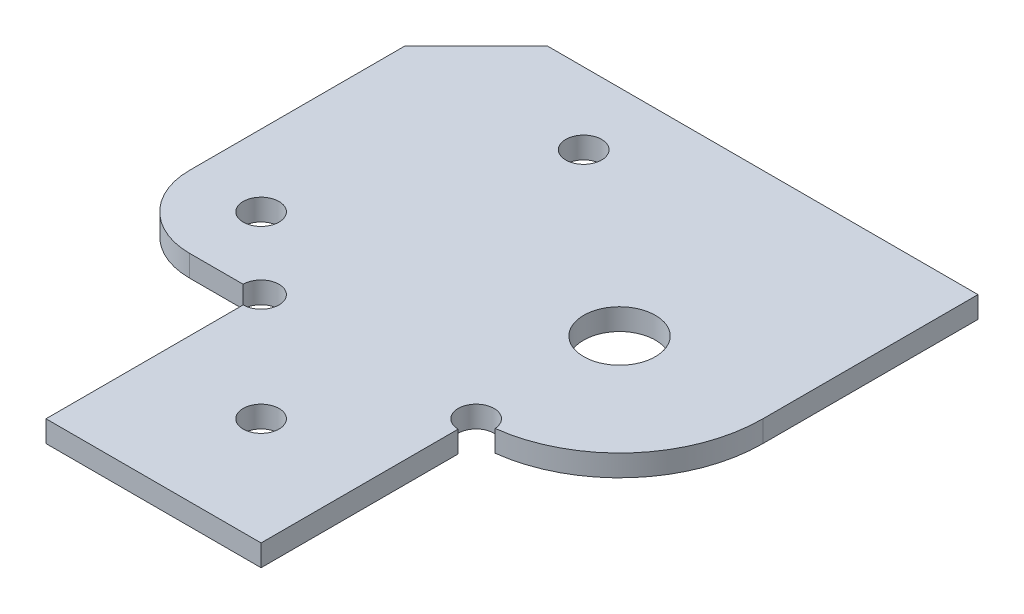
ISO-10303-21;
HEADER;
FILE_DESCRIPTION(('STEP AP214'),'2;1');
FILE_NAME('part.step','',(''),(''),'','','');
FILE_SCHEMA(('AUTOMOTIVE_DESIGN { 1 0 10303 214 1 1 1 1 }'));
ENDSEC;
DATA;
#1=APPLICATION_CONTEXT('core data for automotive mechanical design processes');
#2=APPLICATION_PROTOCOL_DEFINITION('international standard','automotive_design',2000,#1);
#3=PRODUCT_CONTEXT('',#1,'mechanical');
#4=PRODUCT('Part','Part','',(#3));
#5=PRODUCT_RELATED_PRODUCT_CATEGORY('part','',(#4));
#6=PRODUCT_DEFINITION_FORMATION('','',#4);
#7=PRODUCT_DEFINITION_CONTEXT('part definition',#1,'design');
#8=PRODUCT_DEFINITION('design','',#6,#7);
#9=PRODUCT_DEFINITION_SHAPE('','',#8);
#10=(LENGTH_UNIT() NAMED_UNIT(*) SI_UNIT(.MILLI.,.METRE.));
#11=(NAMED_UNIT(*) PLANE_ANGLE_UNIT() SI_UNIT($,.RADIAN.));
#12=(NAMED_UNIT(*) SI_UNIT($,.STERADIAN.) SOLID_ANGLE_UNIT());
#13=UNCERTAINTY_MEASURE_WITH_UNIT(LENGTH_MEASURE(1.E-05),#10,'distance_accuracy_value','');
#14=(GEOMETRIC_REPRESENTATION_CONTEXT(3) GLOBAL_UNCERTAINTY_ASSIGNED_CONTEXT((#13)) GLOBAL_UNIT_ASSIGNED_CONTEXT((#10,
#11,#12)) REPRESENTATION_CONTEXT('',''));
#15=CARTESIAN_POINT('',(0.,0.,0.));
#16=DIRECTION('',(0.,0.,1.));
#17=DIRECTION('',(1.,0.,0.));
#18=AXIS2_PLACEMENT_3D('',#15,#16,#17);
#19=CARTESIAN_POINT('',(10.,3.,-40.));
#20=DIRECTION('',(0.,1.,0.));
#21=DIRECTION('',(0.,0.,1.));
#22=AXIS2_PLACEMENT_3D('',#19,#20,#21);
#23=PLANE('',#22);
#24=CARTESIAN_POINT('',(10.,3.,-40.));
#25=DIRECTION('',(0.,1.,0.));
#26=DIRECTION('',(0.,0.,1.));
#27=AXIS2_PLACEMENT_3D('',#24,#25,#26);
#28=CIRCLE('',#27,2.5);
#29=CARTESIAN_POINT('',(10.,3.,-37.5));
#30=VERTEX_POINT('',#29);
#31=EDGE_CURVE('E287',#30,#30,#28,.T.);
#32=ORIENTED_EDGE('',*,*,#31,.F.);
#33=EDGE_LOOP('',(#32));
#34=FACE_BOUND('',#33,.T.);
#35=CARTESIAN_POINT('',(35.,3.,-15.));
#36=DIRECTION('',(0.,1.,0.));
#37=DIRECTION('',(0.,0.,1.));
#38=AXIS2_PLACEMENT_3D('',#35,#36,#37);
#39=CIRCLE('',#38,2.5);
#40=CARTESIAN_POINT('',(35.,3.,-12.5));
#41=VERTEX_POINT('',#40);
#42=EDGE_CURVE('E153',#41,#41,#39,.T.);
#43=ORIENTED_EDGE('',*,*,#42,.F.);
#44=EDGE_LOOP('',(#43));
#45=FACE_BOUND('',#44,.T.);
#46=DIRECTION('',(0.,0.,-1.));
#47=VECTOR('',#46,1.);
#48=CARTESIAN_POINT('',(70.,3.,-50.));
#49=LINE('',#48,#47);
#50=CARTESIAN_POINT('',(70.,3.,-50.));
#51=VERTEX_POINT('',#50);
#52=CARTESIAN_POINT('',(70.,3.,-80.));
#53=VERTEX_POINT('',#52);
#54=EDGE_CURVE('E172',#51,#53,#49,.T.);
#55=ORIENTED_EDGE('',*,*,#54,.T.);
#56=DIRECTION('',(-1.,0.,0.));
#57=VECTOR('',#56,1.);
#58=CARTESIAN_POINT('',(10.,3.,-80.));
#59=LINE('',#58,#57);
#60=CARTESIAN_POINT('',(10.,3.,-80.));
#61=VERTEX_POINT('',#60);
#62=EDGE_CURVE('E100',#53,#61,#59,.T.);
#63=ORIENTED_EDGE('',*,*,#62,.T.);
#64=DIRECTION('',(-0.707106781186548,0.,0.707106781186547));
#65=VECTOR('',#64,1.);
#66=CARTESIAN_POINT('',(10.,3.,-80.));
#67=LINE('',#66,#65);
#68=CARTESIAN_POINT('',(0.,3.,-70.));
#69=VERTEX_POINT('',#68);
#70=EDGE_CURVE('E199',#61,#69,#67,.T.);
#71=ORIENTED_EDGE('',*,*,#70,.T.);
#72=DIRECTION('',(0.,0.,1.));
#73=VECTOR('',#72,1.);
#74=CARTESIAN_POINT('',(0.,3.,-40.));
#75=LINE('',#74,#73);
#76=CARTESIAN_POINT('',(0.,3.,-40.));
#77=VERTEX_POINT('',#76);
#78=EDGE_CURVE('E218',#69,#77,#75,.T.);
#79=ORIENTED_EDGE('',*,*,#78,.T.);
#80=CARTESIAN_POINT('',(10.,3.,-40.));
#81=DIRECTION('',(0.,1.,0.));
#82=DIRECTION('',(0.,0.,1.));
#83=AXIS2_PLACEMENT_3D('',#80,#81,#82);
#84=CIRCLE('',#83,10.);
#85=CARTESIAN_POINT('',(10.,3.,-30.));
#86=VERTEX_POINT('',#85);
#87=EDGE_CURVE('E215',#77,#86,#84,.T.);
#88=ORIENTED_EDGE('',*,*,#87,.T.);
#89=DIRECTION('',(1.,0.,0.));
#90=VECTOR('',#89,1.);
#91=CARTESIAN_POINT('',(10.,3.,-30.));
#92=LINE('',#91,#90);
#93=CARTESIAN_POINT('',(17.5,3.,-30.));
#94=VERTEX_POINT('',#93);
#95=EDGE_CURVE('E217',#86,#94,#92,.T.);
#96=ORIENTED_EDGE('',*,*,#95,.T.);
#97=CARTESIAN_POINT('',(20.,3.,-30.));
#98=DIRECTION('',(0.,-1.,0.));
#99=DIRECTION('',(0.,0.,1.));
#100=AXIS2_PLACEMENT_3D('',#97,#98,#99);
#101=CIRCLE('',#100,2.5);
#102=CARTESIAN_POINT('',(20.,3.,-27.5));
#103=VERTEX_POINT('',#102);
#104=EDGE_CURVE('E220',#94,#103,#101,.T.);
#105=ORIENTED_EDGE('',*,*,#104,.T.);
#106=DIRECTION('',(0.,0.,1.));
#107=VECTOR('',#106,1.);
#108=CARTESIAN_POINT('',(20.,3.,0.));
#109=LINE('',#108,#107);
#110=CARTESIAN_POINT('',(20.,3.,0.));
#111=VERTEX_POINT('',#110);
#112=EDGE_CURVE('E226',#103,#111,#109,.T.);
#113=ORIENTED_EDGE('',*,*,#112,.T.);
#114=DIRECTION('',(1.,0.,0.));
#115=VECTOR('',#114,1.);
#116=CARTESIAN_POINT('',(20.,3.,0.));
#117=LINE('',#116,#115);
#118=CARTESIAN_POINT('',(50.,3.,0.));
#119=VERTEX_POINT('',#118);
#120=EDGE_CURVE('E131',#111,#119,#117,.T.);
#121=ORIENTED_EDGE('',*,*,#120,.T.);
#122=DIRECTION('',(0.,0.,-1.));
#123=VECTOR('',#122,1.);
#124=CARTESIAN_POINT('',(50.,3.,0.));
#125=LINE('',#124,#123);
#126=CARTESIAN_POINT('',(50.,3.,-27.5));
#127=VERTEX_POINT('',#126);
#128=EDGE_CURVE('E125',#119,#127,#125,.T.);
#129=ORIENTED_EDGE('',*,*,#128,.T.);
#130=CARTESIAN_POINT('',(50.,3.,-30.));
#131=DIRECTION('',(0.,-1.,0.));
#132=DIRECTION('',(0.,0.,1.));
#133=AXIS2_PLACEMENT_3D('',#130,#131,#132);
#134=CIRCLE('',#133,2.5);
#135=CARTESIAN_POINT('',(52.4951124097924,3.,-30.15625));
#136=VERTEX_POINT('',#135);
#137=EDGE_CURVE('E129',#127,#136,#134,.T.);
#138=ORIENTED_EDGE('',*,*,#137,.T.);
#139=CARTESIAN_POINT('',(50.,3.,-50.));
#140=DIRECTION('',(0.,1.,0.));
#141=DIRECTION('',(0.,0.,1.));
#142=AXIS2_PLACEMENT_3D('',#139,#140,#141);
#143=CIRCLE('',#142,20.);
#144=EDGE_CURVE('E45',#136,#51,#143,.T.);
#145=ORIENTED_EDGE('',*,*,#144,.T.);
#146=EDGE_LOOP('',(#55,#63,#71,#79,#88,#96,#105,#113,#121,#129,#138,#145));
#147=FACE_BOUND('',#146,.T.);
#148=CARTESIAN_POINT('',(50.,3.,-50.));
#149=DIRECTION('',(0.,1.,0.));
#150=DIRECTION('',(0.,0.,1.));
#151=AXIS2_PLACEMENT_3D('',#148,#149,#150);
#152=CIRCLE('',#151,5.);
#153=CARTESIAN_POINT('',(50.,3.,-45.));
#154=VERTEX_POINT('',#153);
#155=EDGE_CURVE('E293',#154,#154,#152,.T.);
#156=ORIENTED_EDGE('',*,*,#155,.F.);
#157=EDGE_LOOP('',(#156));
#158=FACE_BOUND('',#157,.T.);
#159=CARTESIAN_POINT('',(25.,3.,-70.));
#160=DIRECTION('',(0.,1.,0.));
#161=DIRECTION('',(0.,0.,1.));
#162=AXIS2_PLACEMENT_3D('',#159,#160,#161);
#163=CIRCLE('',#162,2.5);
#164=CARTESIAN_POINT('',(25.,3.,-67.5));
#165=VERTEX_POINT('',#164);
#166=EDGE_CURVE('E278',#165,#165,#163,.T.);
#167=ORIENTED_EDGE('',*,*,#166,.F.);
#168=EDGE_LOOP('',(#167));
#169=FACE_BOUND('',#168,.T.);
#170=ADVANCED_FACE('F28',(#34,#45,#147,#158,#169),#23,.T.);
#171=CARTESIAN_POINT('',(10.,0.,-40.));
#172=DIRECTION('',(0.,1.,0.));
#173=DIRECTION('',(0.,0.,1.));
#174=AXIS2_PLACEMENT_3D('',#171,#172,#173);
#175=PLANE('',#174);
#176=CARTESIAN_POINT('',(10.,0.,-40.));
#177=DIRECTION('',(0.,1.,0.));
#178=DIRECTION('',(0.,0.,1.));
#179=AXIS2_PLACEMENT_3D('',#176,#177,#178);
#180=CIRCLE('',#179,2.5);
#181=CARTESIAN_POINT('',(10.,0.,-37.5));
#182=VERTEX_POINT('',#181);
#183=EDGE_CURVE('E284',#182,#182,#180,.T.);
#184=ORIENTED_EDGE('',*,*,#183,.T.);
#185=EDGE_LOOP('',(#184));
#186=FACE_BOUND('',#185,.T.);
#187=CARTESIAN_POINT('',(35.,0.,-15.));
#188=DIRECTION('',(0.,1.,0.));
#189=DIRECTION('',(0.,0.,1.));
#190=AXIS2_PLACEMENT_3D('',#187,#188,#189);
#191=CIRCLE('',#190,2.5);
#192=CARTESIAN_POINT('',(35.,0.,-12.5));
#193=VERTEX_POINT('',#192);
#194=EDGE_CURVE('E296',#193,#193,#191,.T.);
#195=ORIENTED_EDGE('',*,*,#194,.T.);
#196=EDGE_LOOP('',(#195));
#197=FACE_BOUND('',#196,.T.);
#198=DIRECTION('',(0.,0.,-1.));
#199=VECTOR('',#198,1.);
#200=CARTESIAN_POINT('',(70.,0.,-50.));
#201=LINE('',#200,#199);
#202=CARTESIAN_POINT('',(70.,0.,-50.));
#203=VERTEX_POINT('',#202);
#204=CARTESIAN_POINT('',(70.,0.,-80.));
#205=VERTEX_POINT('',#204);
#206=EDGE_CURVE('E149',#203,#205,#201,.T.);
#207=ORIENTED_EDGE('',*,*,#206,.F.);
#208=CARTESIAN_POINT('',(50.,0.,-50.));
#209=DIRECTION('',(0.,1.,0.));
#210=DIRECTION('',(0.,0.,1.));
#211=AXIS2_PLACEMENT_3D('',#208,#209,#210);
#212=CIRCLE('',#211,20.);
#213=CARTESIAN_POINT('',(52.4951124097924,0.,-30.15625));
#214=VERTEX_POINT('',#213);
#215=EDGE_CURVE('E92',#214,#203,#212,.T.);
#216=ORIENTED_EDGE('',*,*,#215,.F.);
#217=CARTESIAN_POINT('',(50.,0.,-30.));
#218=DIRECTION('',(0.,-1.,0.));
#219=DIRECTION('',(0.,0.,1.));
#220=AXIS2_PLACEMENT_3D('',#217,#218,#219);
#221=CIRCLE('',#220,2.5);
#222=CARTESIAN_POINT('',(50.,0.,-27.5));
#223=VERTEX_POINT('',#222);
#224=EDGE_CURVE('E86',#223,#214,#221,.T.);
#225=ORIENTED_EDGE('',*,*,#224,.F.);
#226=DIRECTION('',(0.,0.,-1.));
#227=VECTOR('',#226,1.);
#228=CARTESIAN_POINT('',(50.,0.,0.));
#229=LINE('',#228,#227);
#230=CARTESIAN_POINT('',(50.,0.,0.));
#231=VERTEX_POINT('',#230);
#232=EDGE_CURVE('E139',#231,#223,#229,.T.);
#233=ORIENTED_EDGE('',*,*,#232,.F.);
#234=DIRECTION('',(1.,0.,0.));
#235=VECTOR('',#234,1.);
#236=CARTESIAN_POINT('',(20.,0.,0.));
#237=LINE('',#236,#235);
#238=CARTESIAN_POINT('',(20.,0.,0.));
#239=VERTEX_POINT('',#238);
#240=EDGE_CURVE('E167',#239,#231,#237,.T.);
#241=ORIENTED_EDGE('',*,*,#240,.F.);
#242=DIRECTION('',(0.,0.,1.));
#243=VECTOR('',#242,1.);
#244=CARTESIAN_POINT('',(20.,0.,0.));
#245=LINE('',#244,#243);
#246=CARTESIAN_POINT('',(20.,0.,-27.5));
#247=VERTEX_POINT('',#246);
#248=EDGE_CURVE('E165',#247,#239,#245,.T.);
#249=ORIENTED_EDGE('',*,*,#248,.F.);
#250=CARTESIAN_POINT('',(20.,0.,-30.));
#251=DIRECTION('',(0.,-1.,0.));
#252=DIRECTION('',(0.,0.,1.));
#253=AXIS2_PLACEMENT_3D('',#250,#251,#252);
#254=CIRCLE('',#253,2.5);
#255=CARTESIAN_POINT('',(17.5,0.,-30.));
#256=VERTEX_POINT('',#255);
#257=EDGE_CURVE('E163',#256,#247,#254,.T.);
#258=ORIENTED_EDGE('',*,*,#257,.F.);
#259=DIRECTION('',(1.,0.,0.));
#260=VECTOR('',#259,1.);
#261=CARTESIAN_POINT('',(10.,0.,-30.));
#262=LINE('',#261,#260);
#263=CARTESIAN_POINT('',(10.,0.,-30.));
#264=VERTEX_POINT('',#263);
#265=EDGE_CURVE('E161',#264,#256,#262,.T.);
#266=ORIENTED_EDGE('',*,*,#265,.F.);
#267=CARTESIAN_POINT('',(10.,0.,-40.));
#268=DIRECTION('',(0.,1.,0.));
#269=DIRECTION('',(0.,0.,1.));
#270=AXIS2_PLACEMENT_3D('',#267,#268,#269);
#271=CIRCLE('',#270,10.);
#272=CARTESIAN_POINT('',(0.,0.,-40.));
#273=VERTEX_POINT('',#272);
#274=EDGE_CURVE('E159',#273,#264,#271,.T.);
#275=ORIENTED_EDGE('',*,*,#274,.F.);
#276=DIRECTION('',(0.,0.,1.));
#277=VECTOR('',#276,1.);
#278=CARTESIAN_POINT('',(0.,0.,-40.));
#279=LINE('',#278,#277);
#280=CARTESIAN_POINT('',(0.,0.,-70.));
#281=VERTEX_POINT('',#280);
#282=EDGE_CURVE('E157',#281,#273,#279,.T.);
#283=ORIENTED_EDGE('',*,*,#282,.F.);
#284=DIRECTION('',(-0.707106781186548,0.,0.707106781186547));
#285=VECTOR('',#284,1.);
#286=CARTESIAN_POINT('',(10.,0.,-80.));
#287=LINE('',#286,#285);
#288=CARTESIAN_POINT('',(10.,0.,-80.));
#289=VERTEX_POINT('',#288);
#290=EDGE_CURVE('E155',#289,#281,#287,.T.);
#291=ORIENTED_EDGE('',*,*,#290,.F.);
#292=DIRECTION('',(-1.,0.,0.));
#293=VECTOR('',#292,1.);
#294=CARTESIAN_POINT('',(10.,0.,-80.));
#295=LINE('',#294,#293);
#296=EDGE_CURVE('E152',#205,#289,#295,.T.);
#297=ORIENTED_EDGE('',*,*,#296,.F.);
#298=EDGE_LOOP('',(#207,#216,#225,#233,#241,#249,#258,#266,#275,#283,#291,#297));
#299=FACE_BOUND('',#298,.T.);
#300=CARTESIAN_POINT('',(50.,0.,-50.));
#301=DIRECTION('',(0.,1.,0.));
#302=DIRECTION('',(0.,0.,1.));
#303=AXIS2_PLACEMENT_3D('',#300,#301,#302);
#304=CIRCLE('',#303,5.);
#305=CARTESIAN_POINT('',(50.,0.,-45.));
#306=VERTEX_POINT('',#305);
#307=EDGE_CURVE('E290',#306,#306,#304,.T.);
#308=ORIENTED_EDGE('',*,*,#307,.T.);
#309=EDGE_LOOP('',(#308));
#310=FACE_BOUND('',#309,.T.);
#311=CARTESIAN_POINT('',(25.,0.,-70.));
#312=DIRECTION('',(0.,1.,0.));
#313=DIRECTION('',(0.,0.,1.));
#314=AXIS2_PLACEMENT_3D('',#311,#312,#313);
#315=CIRCLE('',#314,2.5);
#316=CARTESIAN_POINT('',(25.,0.,-67.5));
#317=VERTEX_POINT('',#316);
#318=EDGE_CURVE('E281',#317,#317,#315,.T.);
#319=ORIENTED_EDGE('',*,*,#318,.T.);
#320=EDGE_LOOP('',(#319));
#321=FACE_BOUND('',#320,.T.);
#322=ADVANCED_FACE('F203',(#186,#197,#299,#310,#321),#175,.F.);
#323=CARTESIAN_POINT('',(70.,3.,-50.));
#324=DIRECTION('',(-1.,0.,0.));
#325=DIRECTION('',(0.,0.,1.));
#326=AXIS2_PLACEMENT_3D('',#323,#324,#325);
#327=PLANE('',#326);
#328=ORIENTED_EDGE('',*,*,#206,.T.);
#329=DIRECTION('',(0.,-1.,0.));
#330=VECTOR('',#329,1.);
#331=CARTESIAN_POINT('',(70.,3.,-80.));
#332=LINE('',#331,#330);
#333=EDGE_CURVE('E11',#53,#205,#332,.T.);
#334=ORIENTED_EDGE('',*,*,#333,.F.);
#335=ORIENTED_EDGE('',*,*,#54,.F.);
#336=DIRECTION('',(0.,-1.,0.));
#337=VECTOR('',#336,1.);
#338=CARTESIAN_POINT('',(70.,3.,-50.));
#339=LINE('',#338,#337);
#340=EDGE_CURVE('E145',#51,#203,#339,.T.);
#341=ORIENTED_EDGE('',*,*,#340,.T.);
#342=EDGE_LOOP('',(#328,#334,#335,#341));
#343=FACE_BOUND('',#342,.T.);
#344=ADVANCED_FACE('F30',(#343),#327,.F.);
#345=CARTESIAN_POINT('',(10.,3.,-80.));
#346=DIRECTION('',(0.,0.,1.));
#347=DIRECTION('',(1.,0.,0.));
#348=AXIS2_PLACEMENT_3D('',#345,#346,#347);
#349=PLANE('',#348);
#350=ORIENTED_EDGE('',*,*,#296,.T.);
#351=DIRECTION('',(0.,-1.,0.));
#352=VECTOR('',#351,1.);
#353=CARTESIAN_POINT('',(10.,3.,-80.));
#354=LINE('',#353,#352);
#355=EDGE_CURVE('E37',#61,#289,#354,.T.);
#356=ORIENTED_EDGE('',*,*,#355,.F.);
#357=ORIENTED_EDGE('',*,*,#62,.F.);
#358=ORIENTED_EDGE('',*,*,#333,.T.);
#359=EDGE_LOOP('',(#350,#356,#357,#358));
#360=FACE_BOUND('',#359,.T.);
#361=ADVANCED_FACE('F405',(#360),#349,.F.);
#362=CARTESIAN_POINT('',(10.,3.,-80.));
#363=DIRECTION('',(0.707106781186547,0.,0.707106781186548));
#364=DIRECTION('',(0.707106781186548,0.,-0.707106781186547));
#365=AXIS2_PLACEMENT_3D('',#362,#363,#364);
#366=PLANE('',#365);
#367=ORIENTED_EDGE('',*,*,#290,.T.);
#368=DIRECTION('',(0.,-1.,0.));
#369=VECTOR('',#368,1.);
#370=CARTESIAN_POINT('',(0.,3.,-70.));
#371=LINE('',#370,#369);
#372=EDGE_CURVE('E191',#69,#281,#371,.T.);
#373=ORIENTED_EDGE('',*,*,#372,.F.);
#374=ORIENTED_EDGE('',*,*,#70,.F.);
#375=ORIENTED_EDGE('',*,*,#355,.T.);
#376=EDGE_LOOP('',(#367,#373,#374,#375));
#377=FACE_BOUND('',#376,.T.);
#378=ADVANCED_FACE('F197',(#377),#366,.F.);
#379=CARTESIAN_POINT('',(0.,3.,-40.));
#380=DIRECTION('',(1.,0.,0.));
#381=DIRECTION('',(0.,0.,-1.));
#382=AXIS2_PLACEMENT_3D('',#379,#380,#381);
#383=PLANE('',#382);
#384=ORIENTED_EDGE('',*,*,#282,.T.);
#385=DIRECTION('',(0.,-1.,0.));
#386=VECTOR('',#385,1.);
#387=CARTESIAN_POINT('',(0.,3.,-40.));
#388=LINE('',#387,#386);
#389=EDGE_CURVE('E188',#77,#273,#388,.T.);
#390=ORIENTED_EDGE('',*,*,#389,.F.);
#391=ORIENTED_EDGE('',*,*,#78,.F.);
#392=ORIENTED_EDGE('',*,*,#372,.T.);
#393=EDGE_LOOP('',(#384,#390,#391,#392));
#394=FACE_BOUND('',#393,.T.);
#395=ADVANCED_FACE('F209',(#394),#383,.F.);
#396=CARTESIAN_POINT('',(10.,3.,-40.));
#397=DIRECTION('',(0.,-1.,0.));
#398=DIRECTION('',(0.,0.,-1.));
#399=AXIS2_PLACEMENT_3D('',#396,#397,#398);
#400=CYLINDRICAL_SURFACE('',#399,10.);
#401=ORIENTED_EDGE('',*,*,#274,.T.);
#402=DIRECTION('',(0.,-1.,0.));
#403=VECTOR('',#402,1.);
#404=CARTESIAN_POINT('',(10.,3.,-30.));
#405=LINE('',#404,#403);
#406=EDGE_CURVE('E185',#86,#264,#405,.T.);
#407=ORIENTED_EDGE('',*,*,#406,.F.);
#408=ORIENTED_EDGE('',*,*,#87,.F.);
#409=ORIENTED_EDGE('',*,*,#389,.T.);
#410=EDGE_LOOP('',(#401,#407,#408,#409));
#411=FACE_BOUND('',#410,.T.);
#412=ADVANCED_FACE('F213',(#411),#400,.T.);
#413=CARTESIAN_POINT('',(10.,3.,-30.));
#414=DIRECTION('',(0.,0.,-1.));
#415=DIRECTION('',(-1.,0.,0.));
#416=AXIS2_PLACEMENT_3D('',#413,#414,#415);
#417=PLANE('',#416);
#418=ORIENTED_EDGE('',*,*,#265,.T.);
#419=DIRECTION('',(0.,-1.,0.));
#420=VECTOR('',#419,1.);
#421=CARTESIAN_POINT('',(17.5,3.,-30.));
#422=LINE('',#421,#420);
#423=EDGE_CURVE('E182',#94,#256,#422,.T.);
#424=ORIENTED_EDGE('',*,*,#423,.F.);
#425=ORIENTED_EDGE('',*,*,#95,.F.);
#426=ORIENTED_EDGE('',*,*,#406,.T.);
#427=EDGE_LOOP('',(#418,#424,#425,#426));
#428=FACE_BOUND('',#427,.T.);
#429=ADVANCED_FACE('F370',(#428),#417,.F.);
#430=CARTESIAN_POINT('',(20.,3.,-30.));
#431=DIRECTION('',(0.,-1.,0.));
#432=DIRECTION('',(0.,0.,-1.));
#433=AXIS2_PLACEMENT_3D('',#430,#431,#432);
#434=CYLINDRICAL_SURFACE('',#433,2.5);
#435=ORIENTED_EDGE('',*,*,#257,.T.);
#436=DIRECTION('',(0.,-1.,0.));
#437=VECTOR('',#436,1.);
#438=CARTESIAN_POINT('',(20.,3.,-27.5));
#439=LINE('',#438,#437);
#440=EDGE_CURVE('E179',#103,#247,#439,.T.);
#441=ORIENTED_EDGE('',*,*,#440,.F.);
#442=ORIENTED_EDGE('',*,*,#104,.F.);
#443=ORIENTED_EDGE('',*,*,#423,.T.);
#444=EDGE_LOOP('',(#435,#441,#442,#443));
#445=FACE_BOUND('',#444,.T.);
#446=ADVANCED_FACE('F361',(#445),#434,.F.);
#447=CARTESIAN_POINT('',(20.,3.,0.));
#448=DIRECTION('',(1.,0.,0.));
#449=DIRECTION('',(0.,0.,-1.));
#450=AXIS2_PLACEMENT_3D('',#447,#448,#449);
#451=PLANE('',#450);
#452=ORIENTED_EDGE('',*,*,#248,.T.);
#453=DIRECTION('',(0.,-1.,0.));
#454=VECTOR('',#453,1.);
#455=CARTESIAN_POINT('',(20.,3.,0.));
#456=LINE('',#455,#454);
#457=EDGE_CURVE('E176',#111,#239,#456,.T.);
#458=ORIENTED_EDGE('',*,*,#457,.F.);
#459=ORIENTED_EDGE('',*,*,#112,.F.);
#460=ORIENTED_EDGE('',*,*,#440,.T.);
#461=EDGE_LOOP('',(#452,#458,#459,#460));
#462=FACE_BOUND('',#461,.T.);
#463=ADVANCED_FACE('F232',(#462),#451,.F.);
#464=CARTESIAN_POINT('',(20.,3.,0.));
#465=DIRECTION('',(0.,0.,-1.));
#466=DIRECTION('',(-1.,0.,0.));
#467=AXIS2_PLACEMENT_3D('',#464,#465,#466);
#468=PLANE('',#467);
#469=ORIENTED_EDGE('',*,*,#240,.T.);
#470=DIRECTION('',(0.,-1.,0.));
#471=VECTOR('',#470,1.);
#472=CARTESIAN_POINT('',(50.,3.,0.));
#473=LINE('',#472,#471);
#474=EDGE_CURVE('E140',#119,#231,#473,.T.);
#475=ORIENTED_EDGE('',*,*,#474,.F.);
#476=ORIENTED_EDGE('',*,*,#120,.F.);
#477=ORIENTED_EDGE('',*,*,#457,.T.);
#478=EDGE_LOOP('',(#469,#475,#476,#477));
#479=FACE_BOUND('',#478,.T.);
#480=ADVANCED_FACE('F236',(#479),#468,.F.);
#481=CARTESIAN_POINT('',(50.,3.,0.));
#482=DIRECTION('',(-1.,0.,0.));
#483=DIRECTION('',(0.,0.,1.));
#484=AXIS2_PLACEMENT_3D('',#481,#482,#483);
#485=PLANE('',#484);
#486=ORIENTED_EDGE('',*,*,#232,.T.);
#487=DIRECTION('',(0.,-1.,0.));
#488=VECTOR('',#487,1.);
#489=CARTESIAN_POINT('',(50.,3.,-27.5));
#490=LINE('',#489,#488);
#491=EDGE_CURVE('E136',#127,#223,#490,.T.);
#492=ORIENTED_EDGE('',*,*,#491,.F.);
#493=ORIENTED_EDGE('',*,*,#128,.F.);
#494=ORIENTED_EDGE('',*,*,#474,.T.);
#495=EDGE_LOOP('',(#486,#492,#493,#494));
#496=FACE_BOUND('',#495,.T.);
#497=ADVANCED_FACE('F137',(#496),#485,.F.);
#498=CARTESIAN_POINT('',(50.,3.,-30.));
#499=DIRECTION('',(0.,-1.,0.));
#500=DIRECTION('',(0.,0.,-1.));
#501=AXIS2_PLACEMENT_3D('',#498,#499,#500);
#502=CYLINDRICAL_SURFACE('',#501,2.5);
#503=ORIENTED_EDGE('',*,*,#224,.T.);
#504=DIRECTION('',(0.,-1.,0.));
#505=VECTOR('',#504,1.);
#506=CARTESIAN_POINT('',(52.4951124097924,3.,-30.15625));
#507=LINE('',#506,#505);
#508=EDGE_CURVE('E141',#136,#214,#507,.T.);
#509=ORIENTED_EDGE('',*,*,#508,.F.);
#510=ORIENTED_EDGE('',*,*,#137,.F.);
#511=ORIENTED_EDGE('',*,*,#491,.T.);
#512=EDGE_LOOP('',(#503,#509,#510,#511));
#513=FACE_BOUND('',#512,.T.);
#514=ADVANCED_FACE('F143',(#513),#502,.F.);
#515=CARTESIAN_POINT('',(50.,3.,-50.));
#516=DIRECTION('',(0.,-1.,0.));
#517=DIRECTION('',(0.,0.,-1.));
#518=AXIS2_PLACEMENT_3D('',#515,#516,#517);
#519=CYLINDRICAL_SURFACE('',#518,20.);
#520=ORIENTED_EDGE('',*,*,#215,.T.);
#521=ORIENTED_EDGE('',*,*,#340,.F.);
#522=ORIENTED_EDGE('',*,*,#144,.F.);
#523=ORIENTED_EDGE('',*,*,#508,.T.);
#524=EDGE_LOOP('',(#520,#521,#522,#523));
#525=FACE_BOUND('',#524,.T.);
#526=ADVANCED_FACE('F240',(#525),#519,.T.);
#527=CARTESIAN_POINT('',(35.,3.,-15.));
#528=DIRECTION('',(0.,-1.,0.));
#529=DIRECTION('',(0.,0.,-1.));
#530=AXIS2_PLACEMENT_3D('',#527,#528,#529);
#531=CYLINDRICAL_SURFACE('',#530,2.5);
#532=ORIENTED_EDGE('',*,*,#42,.T.);
#533=EDGE_LOOP('',(#532));
#534=FACE_BOUND('',#533,.T.);
#535=ORIENTED_EDGE('',*,*,#194,.F.);
#536=EDGE_LOOP('',(#535));
#537=FACE_BOUND('',#536,.T.);
#538=ADVANCED_FACE('F242',(#534,#537),#531,.F.);
#539=CARTESIAN_POINT('',(50.,3.,-50.));
#540=DIRECTION('',(0.,-1.,0.));
#541=DIRECTION('',(0.,0.,-1.));
#542=AXIS2_PLACEMENT_3D('',#539,#540,#541);
#543=CYLINDRICAL_SURFACE('',#542,5.);
#544=ORIENTED_EDGE('',*,*,#155,.T.);
#545=EDGE_LOOP('',(#544));
#546=FACE_BOUND('',#545,.T.);
#547=ORIENTED_EDGE('',*,*,#307,.F.);
#548=EDGE_LOOP('',(#547));
#549=FACE_BOUND('',#548,.T.);
#550=ADVANCED_FACE('F248',(#546,#549),#543,.F.);
#551=CARTESIAN_POINT('',(10.,3.,-40.));
#552=DIRECTION('',(0.,-1.,0.));
#553=DIRECTION('',(0.,0.,-1.));
#554=AXIS2_PLACEMENT_3D('',#551,#552,#553);
#555=CYLINDRICAL_SURFACE('',#554,2.5);
#556=ORIENTED_EDGE('',*,*,#31,.T.);
#557=EDGE_LOOP('',(#556));
#558=FACE_BOUND('',#557,.T.);
#559=ORIENTED_EDGE('',*,*,#183,.F.);
#560=EDGE_LOOP('',(#559));
#561=FACE_BOUND('',#560,.T.);
#562=ADVANCED_FACE('F265',(#558,#561),#555,.F.);
#563=CARTESIAN_POINT('',(25.,3.,-70.));
#564=DIRECTION('',(0.,-1.,0.));
#565=DIRECTION('',(0.,0.,-1.));
#566=AXIS2_PLACEMENT_3D('',#563,#564,#565);
#567=CYLINDRICAL_SURFACE('',#566,2.5);
#568=ORIENTED_EDGE('',*,*,#166,.T.);
#569=EDGE_LOOP('',(#568));
#570=FACE_BOUND('',#569,.T.);
#571=ORIENTED_EDGE('',*,*,#318,.F.);
#572=EDGE_LOOP('',(#571));
#573=FACE_BOUND('',#572,.T.);
#574=ADVANCED_FACE('F269',(#570,#573),#567,.F.);
#575=CLOSED_SHELL('',(#170,#322,#344,#361,#378,#395,#412,#429,#446,#463,#480,#497,#514,#526,
#538,#550,#562,#574));
#576=MANIFOLD_SOLID_BREP('B2',#575);
#577=ADVANCED_BREP_SHAPE_REPRESENTATION('',(#18,#576),#14);
#578=SHAPE_DEFINITION_REPRESENTATION(#9,#577);
ENDSEC;
END-ISO-10303-21;
